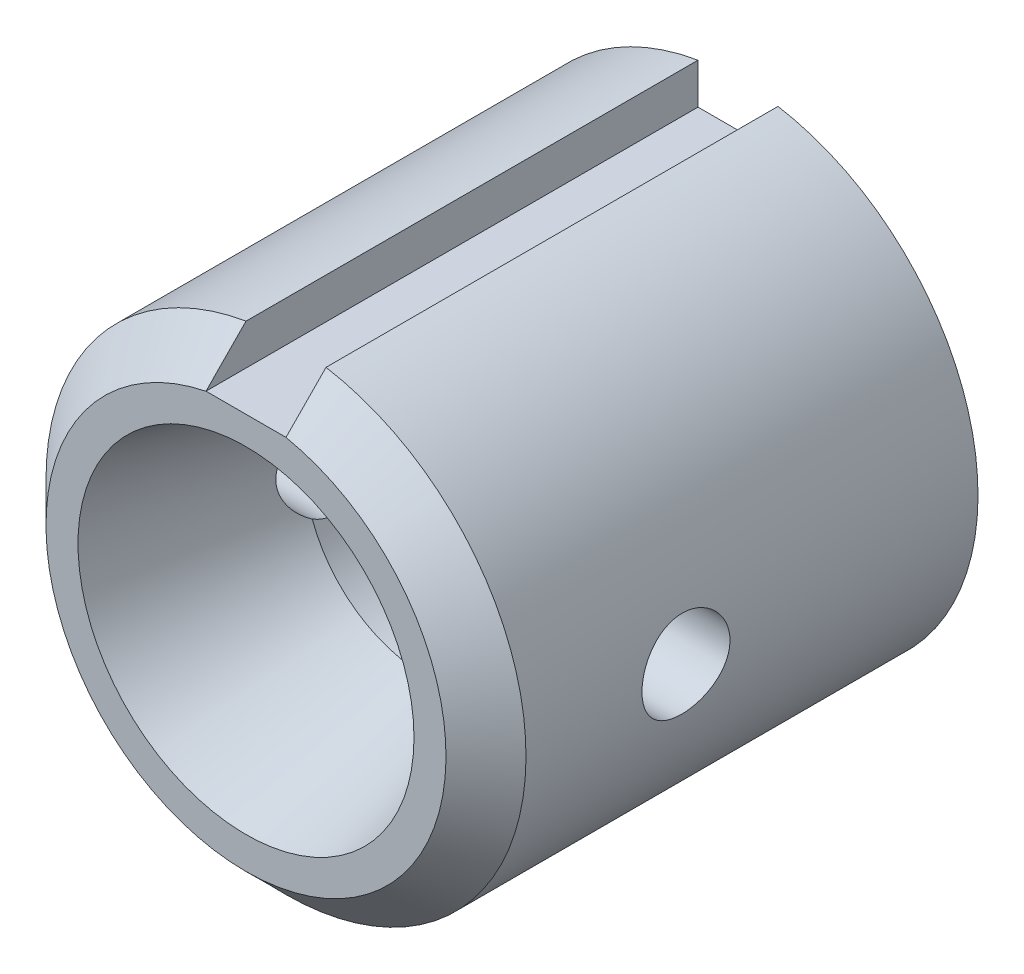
ISO-10303-21;
HEADER;
FILE_DESCRIPTION(('STEP AP214'),'2;1');
FILE_NAME('part.step','',(''),(''),'','','');
FILE_SCHEMA(('AUTOMOTIVE_DESIGN { 1 0 10303 214 1 1 1 1 }'));
ENDSEC;
DATA;
#1=APPLICATION_CONTEXT('core data for automotive mechanical design processes');
#2=APPLICATION_PROTOCOL_DEFINITION('international standard','automotive_design',2000,#1);
#3=PRODUCT_CONTEXT('',#1,'mechanical');
#4=PRODUCT('Part','Part','',(#3));
#5=PRODUCT_RELATED_PRODUCT_CATEGORY('part','',(#4));
#6=PRODUCT_DEFINITION_FORMATION('','',#4);
#7=PRODUCT_DEFINITION_CONTEXT('part definition',#1,'design');
#8=PRODUCT_DEFINITION('design','',#6,#7);
#9=PRODUCT_DEFINITION_SHAPE('','',#8);
#10=(LENGTH_UNIT() NAMED_UNIT(*) SI_UNIT(.MILLI.,.METRE.));
#11=(NAMED_UNIT(*) PLANE_ANGLE_UNIT() SI_UNIT($,.RADIAN.));
#12=(NAMED_UNIT(*) SI_UNIT($,.STERADIAN.) SOLID_ANGLE_UNIT());
#13=UNCERTAINTY_MEASURE_WITH_UNIT(LENGTH_MEASURE(1.E-05),#10,'distance_accuracy_value','');
#14=(GEOMETRIC_REPRESENTATION_CONTEXT(3) GLOBAL_UNCERTAINTY_ASSIGNED_CONTEXT((#13)) GLOBAL_UNIT_ASSIGNED_CONTEXT((#10,
#11,#12)) REPRESENTATION_CONTEXT('',''));
#15=CARTESIAN_POINT('',(0.,0.,0.));
#16=DIRECTION('',(0.,0.,1.));
#17=DIRECTION('',(1.,0.,0.));
#18=AXIS2_PLACEMENT_3D('',#15,#16,#17);
#19=CARTESIAN_POINT('',(60.,295.,6.69999999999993));
#20=DIRECTION('',(0.,0.,1.));
#21=DIRECTION('',(1.,0.,0.));
#22=AXIS2_PLACEMENT_3D('',#19,#20,#21);
#23=CYLINDRICAL_SURFACE('',#22,6.00000000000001);
#24=CARTESIAN_POINT('',(54.0002083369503,294.950000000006,15.1));
#25=CARTESIAN_POINT('',(54.0007202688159,294.888703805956,15.0999976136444));
#26=CARTESIAN_POINT('',(54.0021793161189,294.827384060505,15.0948591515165));
#27=CARTESIAN_POINT('',(54.0068772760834,294.706486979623,15.0744609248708));
#28=CARTESIAN_POINT('',(54.0101177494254,294.646911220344,15.0591922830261));
#29=CARTESIAN_POINT('',(54.0180565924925,294.531267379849,15.019021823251));
#30=CARTESIAN_POINT('',(54.0227536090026,294.475196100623,14.9941289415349));
#31=CARTESIAN_POINT('',(54.0331310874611,294.368037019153,14.9354419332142));
#32=CARTESIAN_POINT('',(54.0388114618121,294.316948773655,14.9016485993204));
#33=CARTESIAN_POINT('',(54.0506392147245,294.22058236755,14.8256843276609));
#34=CARTESIAN_POINT('',(54.0567909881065,294.175373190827,14.7834265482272));
#35=CARTESIAN_POINT('',(54.0688564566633,294.092647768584,14.69191897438));
#36=CARTESIAN_POINT('',(54.0747701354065,294.055132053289,14.6426686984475));
#37=CARTESIAN_POINT('',(54.0857594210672,293.988611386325,14.5381410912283));
#38=CARTESIAN_POINT('',(54.0908288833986,293.959667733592,14.4828240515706));
#39=CARTESIAN_POINT('',(54.099508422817,293.911514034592,14.3679970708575));
#40=CARTESIAN_POINT('',(54.103118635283,293.892303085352,14.3084875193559));
#41=CARTESIAN_POINT('',(54.1084294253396,293.864395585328,14.1877584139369));
#42=CARTESIAN_POINT('',(54.1101534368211,293.855569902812,14.126569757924));
#43=CARTESIAN_POINT('',(54.1115740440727,293.848281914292,14.0035577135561));
#44=CARTESIAN_POINT('',(54.1112708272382,293.849818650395,13.9417343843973));
#45=CARTESIAN_POINT('',(54.1086904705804,293.863111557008,13.8200925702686));
#46=CARTESIAN_POINT('',(54.1064401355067,293.874728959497,13.7602582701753));
#47=CARTESIAN_POINT('',(54.1002528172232,293.907635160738,13.6434043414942));
#48=CARTESIAN_POINT('',(54.0963157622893,293.928924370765,13.5863848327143));
#49=CARTESIAN_POINT('',(54.0871553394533,293.980706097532,13.4763695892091));
#50=CARTESIAN_POINT('',(54.0819241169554,294.011255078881,13.4234011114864));
#51=CARTESIAN_POINT('',(54.0707486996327,294.080646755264,13.3232908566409));
#52=CARTESIAN_POINT('',(54.064804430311,294.119490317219,13.2761496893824));
#53=CARTESIAN_POINT('',(54.0527254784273,294.205127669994,13.1882160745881));
#54=CARTESIAN_POINT('',(54.0465892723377,294.252042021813,13.1475411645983));
#55=CARTESIAN_POINT('',(54.0348733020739,294.352083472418,13.0746204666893));
#56=CARTESIAN_POINT('',(54.029293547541,294.405210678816,13.042374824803));
#57=CARTESIAN_POINT('',(54.0192645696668,294.516347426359,12.9871806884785));
#58=CARTESIAN_POINT('',(54.0148179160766,294.574367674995,12.9642532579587));
#59=CARTESIAN_POINT('',(54.007534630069,294.693538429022,12.9285074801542));
#60=CARTESIAN_POINT('',(54.0046978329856,294.754688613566,12.9156880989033));
#61=CARTESIAN_POINT('',(54.00094206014,294.877443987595,12.9006800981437));
#62=CARTESIAN_POINT('',(53.9999961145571,294.939030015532,12.8983413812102));
#63=CARTESIAN_POINT('',(54.0000039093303,295.061727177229,12.9039671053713));
#64=CARTESIAN_POINT('',(54.0009575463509,295.122838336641,12.9119309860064));
#65=CARTESIAN_POINT('',(54.004599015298,295.242301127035,12.9378026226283));
#66=CARTESIAN_POINT('',(54.0072716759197,295.300672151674,12.9556231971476));
#67=CARTESIAN_POINT('',(54.0140051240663,295.413604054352,13.00061696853));
#68=CARTESIAN_POINT('',(54.0180659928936,295.468164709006,13.0277907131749));
#69=CARTESIAN_POINT('',(54.0271426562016,295.572490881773,13.0910114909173));
#70=CARTESIAN_POINT('',(54.0321670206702,295.622206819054,13.1271390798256));
#71=CARTESIAN_POINT('',(54.0425625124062,295.714926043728,13.2071331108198));
#72=CARTESIAN_POINT('',(54.0479336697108,295.757928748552,13.2510002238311));
#73=CARTESIAN_POINT('',(54.0584705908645,295.836555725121,13.3458878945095));
#74=CARTESIAN_POINT('',(54.0636329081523,295.872080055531,13.3969917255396));
#75=CARTESIAN_POINT('',(54.0730659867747,295.934044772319,13.5045146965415));
#76=CARTESIAN_POINT('',(54.0773367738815,295.960485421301,13.5609336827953));
#77=CARTESIAN_POINT('',(54.0844591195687,296.003419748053,13.6772950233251));
#78=CARTESIAN_POINT('',(54.0873157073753,296.019948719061,13.7372240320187));
#79=CARTESIAN_POINT('',(54.0912836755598,296.042692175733,13.8590627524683));
#80=CARTESIAN_POINT('',(54.0923952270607,296.04890767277,13.9209722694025));
#81=CARTESIAN_POINT('',(54.0927343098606,296.050815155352,14.0440962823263));
#82=CARTESIAN_POINT('',(54.0919877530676,296.04665187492,14.1053085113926));
#83=CARTESIAN_POINT('',(54.0887550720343,296.028236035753,14.226146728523));
#84=CARTESIAN_POINT('',(54.0862689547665,296.013983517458,14.2857727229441));
#85=CARTESIAN_POINT('',(54.0798581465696,295.975853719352,14.4016720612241));
#86=CARTESIAN_POINT('',(54.075935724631,295.951991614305,14.4579505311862));
#87=CARTESIAN_POINT('',(54.0671090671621,295.895334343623,14.5657298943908));
#88=CARTESIAN_POINT('',(54.0622047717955,295.862538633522,14.6172304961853));
#89=CARTESIAN_POINT('',(54.0519089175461,295.78843282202,14.7147228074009));
#90=CARTESIAN_POINT('',(54.0465117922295,295.747016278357,14.760633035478));
#91=CARTESIAN_POINT('',(54.0359147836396,295.65706480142,14.8449011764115));
#92=CARTESIAN_POINT('',(54.0307149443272,295.60852829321,14.8832574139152));
#93=CARTESIAN_POINT('',(54.0210885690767,295.505294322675,14.9515817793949));
#94=CARTESIAN_POINT('',(54.0166678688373,295.45055502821,14.9814875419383));
#95=CARTESIAN_POINT('',(54.0091882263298,295.336768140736,15.0316338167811));
#96=CARTESIAN_POINT('',(54.0061279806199,295.277724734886,15.0518835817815));
#97=CARTESIAN_POINT('',(54.0023561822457,295.173739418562,15.0779473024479));
#98=CARTESIAN_POINT('',(54.0012293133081,295.129408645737,15.0862039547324));
#99=CARTESIAN_POINT('',(53.9999673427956,295.040056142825,15.0972311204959));
#100=CARTESIAN_POINT('',(53.9998322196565,294.995034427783,15.1000017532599));
#101=CARTESIAN_POINT('',(54.0002083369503,294.950000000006,15.1));
#102=B_SPLINE_CURVE_WITH_KNOTS('',3,(#24,#25,#26,#27,#28,#29,#30,#31,#32,#33,#34,#35,#36,#37,
#38,#39,#40,#41,#42,#43,#44,#45,#46,#47,#48,#49,#50,#51,#52,#53,#54,#55,#56,#57,#58,#59,#60,#61,
#62,#63,#64,#65,#66,#67,#68,#69,#70,#71,#72,#73,#74,#75,#76,#77,#78,#79,#80,#81,#82,#83,#84,#85,
#86,#87,#88,#89,#90,#91,#92,#93,#94,#95,#96,#97,#98,#99,#100,#101),.UNSPECIFIED.,.T.,.F.,(4,2,2,
2,2,2,2,2,2,2,2,2,2,2,2,2,2,2,2,2,2,2,2,2,2,2,2,2,2,2,2,2,2,2,2,2,2,2,4),(0.,0.183730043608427,
0.367621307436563,0.551342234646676,0.735046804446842,0.920742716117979,1.10645142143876,
1.29345773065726,1.48044668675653,1.6650851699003,1.84970658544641,2.03182615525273,
2.21395347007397,2.39721450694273,2.58049470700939,2.76679785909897,2.95310423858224,
3.13982945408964,3.3265355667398,3.51055906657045,3.69457255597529,3.87698390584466,
4.05940594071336,4.24353288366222,4.42767579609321,4.61414208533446,4.8006029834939,
4.986395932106,5.17217066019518,5.35536925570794,5.53856711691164,5.72147681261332,
5.90439765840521,6.08972747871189,6.27509835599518,6.46180354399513,6.6483294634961,
6.78331920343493,6.91830600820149),.UNSPECIFIED.);
#103=CARTESIAN_POINT('',(54.0002083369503,294.950000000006,15.1));
#104=VERTEX_POINT('',#103);
#105=EDGE_CURVE('E116',#104,#104,#102,.T.);
#106=ORIENTED_EDGE('',*,*,#105,.T.);
#107=EDGE_LOOP('',(#106));
#108=FACE_BOUND('',#107,.T.);
#109=DIRECTION('',(0.,0.,-1.));
#110=VECTOR('',#109,1.);
#111=CARTESIAN_POINT('',(61.,300.9160797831,19.));
#112=LINE('',#111,#110);
#113=CARTESIAN_POINT('',(61.,300.9160797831,17.9999999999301));
#114=VERTEX_POINT('',#113);
#115=CARTESIAN_POINT('',(61.,300.9160797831,6.69999999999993));
#116=VERTEX_POINT('',#115);
#117=EDGE_CURVE('E217',#114,#116,#112,.T.);
#118=ORIENTED_EDGE('',*,*,#117,.F.);
#119=CARTESIAN_POINT('',(60.,295.,17.9999999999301));
#120=DIRECTION('',(0.,0.,1.));
#121=DIRECTION('',(1.,0.,0.));
#122=AXIS2_PLACEMENT_3D('',#119,#120,#121);
#123=CIRCLE('',#122,6.00000000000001);
#124=CARTESIAN_POINT('',(59.,300.9160797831,17.9999999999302));
#125=VERTEX_POINT('',#124);
#126=EDGE_CURVE('E64',#114,#125,#123,.F.);
#127=ORIENTED_EDGE('',*,*,#126,.T.);
#128=DIRECTION('',(0.,0.,-1.));
#129=VECTOR('',#128,1.);
#130=CARTESIAN_POINT('',(59.,300.9160797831,19.));
#131=LINE('',#130,#129);
#132=CARTESIAN_POINT('',(59.,300.9160797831,6.69999999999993));
#133=VERTEX_POINT('',#132);
#134=EDGE_CURVE('E192',#125,#133,#131,.T.);
#135=ORIENTED_EDGE('',*,*,#134,.T.);
#136=CARTESIAN_POINT('',(60.,295.,6.69999999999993));
#137=DIRECTION('',(0.,0.,1.));
#138=DIRECTION('',(1.,0.,0.));
#139=AXIS2_PLACEMENT_3D('',#136,#137,#138);
#140=CIRCLE('',#139,6.00000000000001);
#141=EDGE_CURVE('E199',#133,#116,#140,.T.);
#142=ORIENTED_EDGE('',*,*,#141,.T.);
#143=EDGE_LOOP('',(#118,#127,#135,#142));
#144=FACE_BOUND('',#143,.T.);
#145=CARTESIAN_POINT('',(65.9997916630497,294.950000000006,15.1));
#146=CARTESIAN_POINT('',(66.0003004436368,295.011181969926,15.0999976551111));
#147=CARTESIAN_POINT('',(65.9998661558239,295.072402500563,15.0948783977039));
#148=CARTESIAN_POINT('',(65.9971955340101,295.193136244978,15.0745412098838));
#149=CARTESIAN_POINT('',(65.9949576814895,295.252647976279,15.0593147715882));
#150=CARTESIAN_POINT('',(65.9889710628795,295.368199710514,15.0192372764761));
#151=CARTESIAN_POINT('',(65.9852235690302,295.424242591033,14.994394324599));
#152=CARTESIAN_POINT('',(65.9766665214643,295.531364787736,14.9358111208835));
#153=CARTESIAN_POINT('',(65.9718570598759,295.582444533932,14.9020716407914));
#154=CARTESIAN_POINT('',(65.9616835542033,295.678748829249,14.8262665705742));
#155=CARTESIAN_POINT('',(65.9563145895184,295.723911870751,14.7841234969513));
#156=CARTESIAN_POINT('',(65.9456861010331,295.806571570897,14.6928747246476));
#157=CARTESIAN_POINT('',(65.9404265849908,295.844067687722,14.6437685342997));
#158=CARTESIAN_POINT('',(65.9305917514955,295.910618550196,14.5395062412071));
#159=CARTESIAN_POINT('',(65.9260222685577,295.939603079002,14.4843047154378));
#160=CARTESIAN_POINT('',(65.9181687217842,295.98786671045,14.3697247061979));
#161=CARTESIAN_POINT('',(65.914884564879,296.007146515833,14.3103465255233));
#162=CARTESIAN_POINT('',(65.9100270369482,296.035270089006,14.1897049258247));
#163=CARTESIAN_POINT('',(65.9084374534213,296.044212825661,14.1284652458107));
#164=CARTESIAN_POINT('',(65.907106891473,296.051714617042,14.0053356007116));
#165=CARTESIAN_POINT('',(65.9073657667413,296.050274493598,13.9434456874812));
#166=CARTESIAN_POINT('',(65.9096862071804,296.037136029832,13.8215315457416));
#167=CARTESIAN_POINT('',(65.9117267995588,296.02555703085,13.7614939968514));
#168=CARTESIAN_POINT('',(65.9173395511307,295.992657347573,13.6442267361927));
#169=CARTESIAN_POINT('',(65.9209117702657,295.971336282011,13.5869971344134));
#170=CARTESIAN_POINT('',(65.9291923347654,295.919439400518,13.4766203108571));
#171=CARTESIAN_POINT('',(65.9339065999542,295.888815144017,13.4234963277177));
#172=CARTESIAN_POINT('',(65.9439147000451,295.819213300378,13.3230950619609));
#173=CARTESIAN_POINT('',(65.9492085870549,295.780234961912,13.2758183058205));
#174=CARTESIAN_POINT('',(65.9598411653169,295.694395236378,13.1877766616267));
#175=CARTESIAN_POINT('',(65.965179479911,295.64743338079,13.147109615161));
#176=CARTESIAN_POINT('',(65.9751983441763,295.54729563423,13.0742176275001));
#177=CARTESIAN_POINT('',(65.9798788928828,295.494119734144,13.0419926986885));
#178=CARTESIAN_POINT('',(65.9880210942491,295.383017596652,12.9869155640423));
#179=CARTESIAN_POINT('',(65.9914825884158,295.325090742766,12.9640645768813));
#180=CARTESIAN_POINT('',(65.9967527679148,295.206146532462,12.9284393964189));
#181=CARTESIAN_POINT('',(65.9985616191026,295.145129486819,12.9156641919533));
#182=CARTESIAN_POINT('',(66.0002655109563,295.022644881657,12.9006926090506));
#183=CARTESIAN_POINT('',(66.0001867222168,294.961195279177,12.8983521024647));
#184=CARTESIAN_POINT('',(65.9981463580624,294.838796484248,12.9039221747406));
#185=CARTESIAN_POINT('',(65.9961848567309,294.777847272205,12.9118323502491));
#186=CARTESIAN_POINT('',(65.9905729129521,294.65855865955,12.9375675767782));
#187=CARTESIAN_POINT('',(65.9869329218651,294.60020552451,12.9553314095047));
#188=CARTESIAN_POINT('',(65.9783240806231,294.487311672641,13.0001951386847));
#189=CARTESIAN_POINT('',(65.9733551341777,294.432771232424,13.0272957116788));
#190=CARTESIAN_POINT('',(65.962523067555,294.328353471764,13.0904281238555));
#191=CARTESIAN_POINT('',(65.9566502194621,294.27853776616,13.1265601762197));
#192=CARTESIAN_POINT('',(65.9446610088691,294.185626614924,13.2065936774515));
#193=CARTESIAN_POINT('',(65.9385446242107,294.142531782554,13.2504958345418));
#194=CARTESIAN_POINT('',(65.9266354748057,294.063728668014,13.345493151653));
#195=CARTESIAN_POINT('',(65.9208477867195,294.028120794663,13.3966723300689));
#196=CARTESIAN_POINT('',(65.910318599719,293.96601232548,13.504386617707));
#197=CARTESIAN_POINT('',(65.9055770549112,293.93951133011,13.5609214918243));
#198=CARTESIAN_POINT('',(65.8977001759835,293.896546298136,13.6774079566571));
#199=CARTESIAN_POINT('',(65.8945554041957,293.88002317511,13.7373370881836));
#200=CARTESIAN_POINT('',(65.8901913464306,293.857291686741,13.859186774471));
#201=CARTESIAN_POINT('',(65.8889718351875,293.851082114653,13.9211070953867));
#202=CARTESIAN_POINT('',(65.8886028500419,293.849192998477,14.0440869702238));
#203=CARTESIAN_POINT('',(65.8894195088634,293.853341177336,14.10514384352));
#204=CARTESIAN_POINT('',(65.8929589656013,293.871673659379,14.2256726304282));
#205=CARTESIAN_POINT('',(65.8956817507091,293.885857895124,14.2851445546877));
#206=CARTESIAN_POINT('',(65.9027228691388,293.923788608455,14.4007288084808));
#207=CARTESIAN_POINT('',(65.9070382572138,293.947517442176,14.4568471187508));
#208=CARTESIAN_POINT('',(65.9167969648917,294.003843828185,14.5643321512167));
#209=CARTESIAN_POINT('',(65.9222403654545,294.036442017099,14.6156985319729));
#210=CARTESIAN_POINT('',(65.9337698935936,294.110177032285,14.7130814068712));
#211=CARTESIAN_POINT('',(65.9398646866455,294.151438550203,14.7590024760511));
#212=CARTESIAN_POINT('',(65.9519794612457,294.241065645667,14.8433259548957));
#213=CARTESIAN_POINT('',(65.9579994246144,294.28943291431,14.881726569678));
#214=CARTESIAN_POINT('',(65.9693903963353,294.392472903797,14.950279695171));
#215=CARTESIAN_POINT('',(65.9747543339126,294.447203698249,14.980346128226));
#216=CARTESIAN_POINT('',(65.9841912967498,294.561020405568,15.0308067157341));
#217=CARTESIAN_POINT('',(65.9882655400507,294.620102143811,15.0512100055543));
#218=CARTESIAN_POINT('',(65.9938325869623,294.724467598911,15.077588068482));
#219=CARTESIAN_POINT('',(65.9957260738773,294.769135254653,15.0859775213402));
#220=CARTESIAN_POINT('',(65.9985167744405,294.85919487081,15.0971842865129));
#221=CARTESIAN_POINT('',(65.9994140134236,294.904586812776,15.1000017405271));
#222=CARTESIAN_POINT('',(65.9997916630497,294.950000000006,15.1));
#223=B_SPLINE_CURVE_WITH_KNOTS('',3,(#145,#146,#147,#148,#149,#150,#151,#152,#153,#154,#155,
#156,#157,#158,#159,#160,#161,#162,#163,#164,#165,#166,#167,#168,#169,#170,#171,#172,#173,#174,
#175,#176,#177,#178,#179,#180,#181,#182,#183,#184,#185,#186,#187,#188,#189,#190,#191,#192,#193,
#194,#195,#196,#197,#198,#199,#200,#201,#202,#203,#204,#205,#206,#207,#208,#209,#210,#211,#212,
#213,#214,#215,#216,#217,#218,#219,#220,#221,#222),.UNSPECIFIED.,.T.,.F.,(4,2,2,2,2,2,2,2,2,2,2,
2,2,2,2,2,2,2,2,2,2,2,2,2,2,2,2,2,2,2,2,2,2,2,2,2,2,2,4),(0.,0.183386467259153,
0.366927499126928,0.550314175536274,0.733684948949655,0.918831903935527,1.10399193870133,
1.29063911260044,1.47727276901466,1.66210436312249,1.84692132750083,2.0295916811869,
2.21226918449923,2.3959146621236,2.57957666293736,2.76574908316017,2.95192177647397,
3.13811866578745,3.32429686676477,3.5078953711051,3.69148665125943,3.87394989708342,
4.05642636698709,4.24102521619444,4.42564089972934,4.61259355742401,4.79953801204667,
4.98536428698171,5.17116881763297,5.35390357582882,5.53663710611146,5.71903438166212,
5.9014447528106,6.08668671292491,6.27197283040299,6.45910680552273,6.64606351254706,
6.78218818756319,6.91830940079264),.UNSPECIFIED.);
#224=CARTESIAN_POINT('',(65.9997916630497,294.950000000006,15.1));
#225=VERTEX_POINT('',#224);
#226=EDGE_CURVE('E118',#225,#225,#223,.T.);
#227=ORIENTED_EDGE('',*,*,#226,.T.);
#228=EDGE_LOOP('',(#227));
#229=FACE_BOUND('',#228,.T.);
#230=ADVANCED_FACE('F36',(#108,#144,#229),#23,.T.);
#231=CARTESIAN_POINT('',(60.,295.,6.69999999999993));
#232=DIRECTION('',(0.,0.,-1.));
#233=DIRECTION('',(-1.,0.,0.));
#234=AXIS2_PLACEMENT_3D('',#231,#232,#233);
#235=CYLINDRICAL_SURFACE('',#234,3.00000000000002);
#236=CARTESIAN_POINT('',(60.,295.,6.69999999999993));
#237=DIRECTION('',(0.,0.,-1.));
#238=DIRECTION('',(-1.,0.,0.));
#239=AXIS2_PLACEMENT_3D('',#236,#237,#238);
#240=CIRCLE('',#239,3.00000000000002);
#241=CARTESIAN_POINT('',(57.,295.,6.69999999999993));
#242=VERTEX_POINT('',#241);
#243=EDGE_CURVE('E146',#242,#242,#240,.T.);
#244=ORIENTED_EDGE('',*,*,#243,.T.);
#245=EDGE_LOOP('',(#244));
#246=FACE_BOUND('',#245,.T.);
#247=CARTESIAN_POINT('',(62.9995833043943,294.950000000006,15.1));
#248=CARTESIAN_POINT('',(63.0005759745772,295.009464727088,15.10000192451));
#249=CARTESIAN_POINT('',(62.9997818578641,295.068946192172,15.0951631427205));
#250=CARTESIAN_POINT('',(62.9947907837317,295.186198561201,15.0759822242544));
#251=CARTESIAN_POINT('',(62.9905943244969,295.243969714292,15.061641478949));
#252=CARTESIAN_POINT('',(62.9793242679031,295.356090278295,15.0240037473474));
#253=CARTESIAN_POINT('',(62.9722555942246,295.410445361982,15.0007220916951));
#254=CARTESIAN_POINT('',(62.9560222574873,295.514498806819,14.9459390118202));
#255=CARTESIAN_POINT('',(62.9468570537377,295.56419596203,14.9144354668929));
#256=CARTESIAN_POINT('',(62.927050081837,295.659412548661,14.8428535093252));
#257=CARTESIAN_POINT('',(62.9163684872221,295.704730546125,14.8025183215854));
#258=CARTESIAN_POINT('',(62.894942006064,295.788142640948,14.7149647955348));
#259=CARTESIAN_POINT('',(62.8841971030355,295.826234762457,14.6677445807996));
#260=CARTESIAN_POINT('',(62.8634619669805,295.895513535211,14.5656402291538));
#261=CARTESIAN_POINT('',(62.8535146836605,295.926390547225,14.5105363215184));
#262=CARTESIAN_POINT('',(62.83611660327,295.978365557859,14.3955282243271));
#263=CARTESIAN_POINT('',(62.8286650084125,295.999466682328,14.3356255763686));
#264=CARTESIAN_POINT('',(62.8174834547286,296.030559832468,14.2148211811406));
#265=CARTESIAN_POINT('',(62.8136369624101,296.040900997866,14.1540204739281));
#266=CARTESIAN_POINT('',(62.80978080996,296.051268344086,14.0314345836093));
#267=CARTESIAN_POINT('',(62.809769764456,296.051298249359,13.9696497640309));
#268=CARTESIAN_POINT('',(62.8134799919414,296.041322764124,13.8502860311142));
#269=CARTESIAN_POINT('',(62.8170062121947,296.031841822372,13.7926560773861));
#270=CARTESIAN_POINT('',(62.8270526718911,296.003987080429,13.6798641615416));
#271=CARTESIAN_POINT('',(62.8335733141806,295.985612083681,13.6247025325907));
#272=CARTESIAN_POINT('',(62.848964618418,295.940202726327,13.5173491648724));
#273=CARTESIAN_POINT('',(62.8578719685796,295.91303166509,13.4652207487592));
#274=CARTESIAN_POINT('',(62.8769854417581,295.850887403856,13.3661023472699));
#275=CARTESIAN_POINT('',(62.8871919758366,295.815911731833,13.3191139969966));
#276=CARTESIAN_POINT('',(62.9084323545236,295.736745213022,13.228737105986));
#277=CARTESIAN_POINT('',(62.9194798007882,295.692136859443,13.185716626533));
#278=CARTESIAN_POINT('',(62.9405732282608,295.596187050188,13.1076619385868));
#279=CARTESIAN_POINT('',(62.9506191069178,295.544844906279,13.0726285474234));
#280=CARTESIAN_POINT('',(62.9686391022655,295.436166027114,13.0112775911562));
#281=CARTESIAN_POINT('',(62.9765921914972,295.378776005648,12.9850478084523));
#282=CARTESIAN_POINT('',(62.9893032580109,295.260044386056,12.9427204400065));
#283=CARTESIAN_POINT('',(62.9940625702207,295.198704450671,12.9266186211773));
#284=CARTESIAN_POINT('',(62.9995935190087,295.077151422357,12.9057230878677));
#285=CARTESIAN_POINT('',(63.0005544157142,295.01703788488,12.9003993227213));
#286=CARTESIAN_POINT('',(62.9988270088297,294.896808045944,12.8996442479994));
#287=CARTESIAN_POINT('',(62.9961393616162,294.836691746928,12.90421115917));
#288=CARTESIAN_POINT('',(62.9874731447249,294.720155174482,12.9227151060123));
#289=CARTESIAN_POINT('',(62.9816020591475,294.663678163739,12.9363492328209));
#290=CARTESIAN_POINT('',(62.9671610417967,294.553878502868,12.9721749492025));
#291=CARTESIAN_POINT('',(62.9585907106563,294.5005563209,12.9943678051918));
#292=CARTESIAN_POINT('',(62.9391836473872,294.3966015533,13.0474924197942));
#293=CARTESIAN_POINT('',(62.928280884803,294.346117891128,13.0786908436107));
#294=CARTESIAN_POINT('',(62.9053955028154,294.250949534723,13.1486369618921));
#295=CARTESIAN_POINT('',(62.8934124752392,294.206267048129,13.1873875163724));
#296=CARTESIAN_POINT('',(62.8687911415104,294.121304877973,13.2739503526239));
#297=CARTESIAN_POINT('',(62.8561544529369,294.081421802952,13.3221534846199));
#298=CARTESIAN_POINT('',(62.8322813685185,294.010254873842,13.4248633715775));
#299=CARTESIAN_POINT('',(62.8210450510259,293.978971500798,13.4793704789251));
#300=CARTESIAN_POINT('',(62.8013143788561,293.926016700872,13.5933065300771));
#301=CARTESIAN_POINT('',(62.7928180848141,293.904338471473,13.6527319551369));
#302=CARTESIAN_POINT('',(62.7796918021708,293.871446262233,13.7748088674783));
#303=CARTESIAN_POINT('',(62.7750592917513,293.860225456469,13.8374582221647));
#304=CARTESIAN_POINT('',(62.7704831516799,293.849150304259,13.9596036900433));
#305=CARTESIAN_POINT('',(62.770241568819,293.848573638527,14.0190238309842));
#306=CARTESIAN_POINT('',(62.773716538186,293.856970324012,14.1370617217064));
#307=CARTESIAN_POINT('',(62.7774327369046,293.865942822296,14.1956795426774));
#308=CARTESIAN_POINT('',(62.7881822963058,293.892644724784,14.308657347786));
#309=CARTESIAN_POINT('',(62.7951120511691,293.910101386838,14.3630924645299));
#310=CARTESIAN_POINT('',(62.8114759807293,293.9530386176,14.4682927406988));
#311=CARTESIAN_POINT('',(62.8209107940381,293.978521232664,14.519056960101));
#312=CARTESIAN_POINT('',(62.841900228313,294.038406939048,14.61850629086));
#313=CARTESIAN_POINT('',(62.8535428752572,294.073223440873,14.6669236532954));
#314=CARTESIAN_POINT('',(62.8773825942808,294.150124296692,14.7574489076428));
#315=CARTESIAN_POINT('',(62.8895798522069,294.192211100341,14.7995546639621));
#316=CARTESIAN_POINT('',(62.91405170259,294.28533447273,14.8787286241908));
#317=CARTESIAN_POINT('',(62.926290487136,294.336746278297,14.9153684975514));
#318=CARTESIAN_POINT('',(62.9488141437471,294.445409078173,14.9794727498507));
#319=CARTESIAN_POINT('',(62.9590988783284,294.502660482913,15.0069364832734));
#320=CARTESIAN_POINT('',(62.9769360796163,294.623558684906,15.0524974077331));
#321=CARTESIAN_POINT('',(62.9843800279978,294.687359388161,15.0702321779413));
#322=CARTESIAN_POINT('',(62.9951492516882,294.817433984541,15.093979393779));
#323=CARTESIAN_POINT('',(62.9984766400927,294.883706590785,15.0999978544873));
#324=CARTESIAN_POINT('',(62.9995833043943,294.950000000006,15.1));
#325=B_SPLINE_CURVE_WITH_KNOTS('',3,(#247,#248,#249,#250,#251,#252,#253,#254,#255,#256,#257,
#258,#259,#260,#261,#262,#263,#264,#265,#266,#267,#268,#269,#270,#271,#272,#273,#274,#275,#276,
#277,#278,#279,#280,#281,#282,#283,#284,#285,#286,#287,#288,#289,#290,#291,#292,#293,#294,#295,
#296,#297,#298,#299,#300,#301,#302,#303,#304,#305,#306,#307,#308,#309,#310,#311,#312,#313,#314,
#315,#316,#317,#318,#319,#320,#321,#322,#323,#324),.UNSPECIFIED.,.T.,.F.,(4,2,2,2,2,2,2,2,2,2,2,
2,2,2,2,2,2,2,2,2,2,2,2,2,2,2,2,2,2,2,2,2,2,2,2,2,2,2,4),(0.,0.178176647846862,0.35632721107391,
0.534173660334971,0.712066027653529,0.896052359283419,1.08008892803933,1.27097245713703,
1.46179490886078,1.64621170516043,1.83056188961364,2.00527635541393,2.18001433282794,
2.35760997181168,2.53526194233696,2.72324133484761,2.91123995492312,3.10106101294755,
3.29080268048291,3.47096131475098,3.65108754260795,3.8254797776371,3.99989782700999,
4.1801304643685,4.36043148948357,4.55101869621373,4.74161656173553,4.9320792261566,
5.12241748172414,5.29978787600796,5.47714242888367,5.64913896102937,5.82117938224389,
6.00267834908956,6.1842385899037,6.37622860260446,6.56823211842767,6.76697189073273,
6.96560960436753),.UNSPECIFIED.);
#326=CARTESIAN_POINT('',(62.855932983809,295.918502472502,14.5215390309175));
#327=VERTEX_POINT('',#326);
#328=CARTESIAN_POINT('',(62.8218172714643,293.981497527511,14.5215390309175));
#329=VERTEX_POINT('',#328);
#330=EDGE_CURVE('E111',#327,#329,#325,.T.);
#331=ORIENTED_EDGE('',*,*,#330,.F.);
#332=CARTESIAN_POINT('',(60.,295.,14.5215390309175));
#333=DIRECTION('',(0.,0.,1.));
#334=DIRECTION('',(1.,0.,0.));
#335=AXIS2_PLACEMENT_3D('',#332,#333,#334);
#336=CIRCLE('',#335,3.00000000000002);
#337=CARTESIAN_POINT('',(57.144067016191,295.918502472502,14.5215390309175));
#338=VERTEX_POINT('',#337);
#339=EDGE_CURVE('E101',#327,#338,#336,.T.);
#340=ORIENTED_EDGE('',*,*,#339,.T.);
#341=CARTESIAN_POINT('',(57.,295.,15.0988630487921));
#342=CARTESIAN_POINT('',(56.9999987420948,294.940547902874,15.1015699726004));
#343=CARTESIAN_POINT('',(57.0017828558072,294.88088745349,15.0994328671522));
#344=CARTESIAN_POINT('',(57.0088001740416,294.762904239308,15.0855974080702));
#345=CARTESIAN_POINT('',(57.0140328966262,294.704581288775,15.0739003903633));
#346=CARTESIAN_POINT('',(57.0274604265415,294.591005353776,15.04144461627));
#347=CARTESIAN_POINT('',(57.0356499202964,294.535747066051,15.02070210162));
#348=CARTESIAN_POINT('',(57.0542420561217,294.429543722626,14.970859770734));
#349=CARTESIAN_POINT('',(57.0646452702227,294.378599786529,14.941757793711));
#350=CARTESIAN_POINT('',(57.0871309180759,294.280399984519,14.8748112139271));
#351=CARTESIAN_POINT('',(57.0992606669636,294.233345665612,14.8366871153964));
#352=CARTESIAN_POINT('',(57.1237261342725,294.146124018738,14.7532775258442));
#353=CARTESIAN_POINT('',(57.1360619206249,294.105959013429,14.7079896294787));
#354=CARTESIAN_POINT('',(57.1602183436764,294.031895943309,14.6091480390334));
#355=CARTESIAN_POINT('',(57.17199312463,293.998347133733,14.5553201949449));
#356=CARTESIAN_POINT('',(57.1930187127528,293.940850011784,14.4423030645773));
#357=CARTESIAN_POINT('',(57.202270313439,293.916898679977,14.3831154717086));
#358=CARTESIAN_POINT('',(57.2167736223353,293.880164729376,14.2631527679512));
#359=CARTESIAN_POINT('',(57.2221523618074,293.867025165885,14.2025029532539));
#360=CARTESIAN_POINT('',(57.2286818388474,293.851142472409,14.0796451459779));
#361=CARTESIAN_POINT('',(57.2298347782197,293.848393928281,14.0174379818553));
#362=CARTESIAN_POINT('',(57.2278272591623,293.853239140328,13.8977108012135));
#363=CARTESIAN_POINT('',(57.2249515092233,293.860150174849,13.8401567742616));
#364=CARTESIAN_POINT('',(57.2157453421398,293.882827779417,13.7271124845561));
#365=CARTESIAN_POINT('',(57.2094145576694,293.898595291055,13.6716224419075));
#366=CARTESIAN_POINT('',(57.1939739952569,293.938550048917,13.5637660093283));
#367=CARTESIAN_POINT('',(57.1848460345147,293.962792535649,13.5114228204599));
#368=CARTESIAN_POINT('',(57.164787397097,294.018951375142,13.4114079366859));
#369=CARTESIAN_POINT('',(57.1538561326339,294.050870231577,13.3637377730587));
#370=CARTESIAN_POINT('',(57.1304498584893,294.124068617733,13.2709125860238));
#371=CARTESIAN_POINT('',(57.1179203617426,294.165844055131,13.2261617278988));
#372=CARTESIAN_POINT('',(57.0932652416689,294.256300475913,13.144131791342));
#373=CARTESIAN_POINT('',(57.0811397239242,294.304983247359,13.1068546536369));
#374=CARTESIAN_POINT('',(57.0581333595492,294.409760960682,13.039723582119));
#375=CARTESIAN_POINT('',(57.0473033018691,294.466040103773,13.0101382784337));
#376=CARTESIAN_POINT('',(57.0284945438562,294.583260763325,12.9609923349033));
#377=CARTESIAN_POINT('',(57.0205147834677,294.644200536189,12.9414279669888));
#378=CARTESIAN_POINT('',(57.0085330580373,294.766106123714,12.9137623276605));
#379=CARTESIAN_POINT('',(57.0043685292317,294.826947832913,12.905185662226));
#380=CARTESIAN_POINT('',(56.9998034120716,294.949342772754,12.8982952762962));
#381=CARTESIAN_POINT('',(56.9994016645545,295.010895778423,12.8999783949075));
#382=CARTESIAN_POINT('',(57.0022479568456,295.129819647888,12.9132283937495));
#383=CARTESIAN_POINT('',(57.0053211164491,295.187249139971,12.9243152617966));
#384=CARTESIAN_POINT('',(57.0144477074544,295.299407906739,12.9553466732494));
#385=CARTESIAN_POINT('',(57.0205013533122,295.354136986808,12.9752918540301));
#386=CARTESIAN_POINT('',(57.0350301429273,295.460292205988,13.0237533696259));
#387=CARTESIAN_POINT('',(57.0435397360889,295.51165761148,13.0523919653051));
#388=CARTESIAN_POINT('',(57.0620471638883,295.609009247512,13.1173150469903));
#389=CARTESIAN_POINT('',(57.072045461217,295.654993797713,13.1536019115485));
#390=CARTESIAN_POINT('',(57.093069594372,295.742905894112,13.2350922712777));
#391=CARTESIAN_POINT('',(57.1041217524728,295.784478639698,13.2806723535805));
#392=CARTESIAN_POINT('',(57.1254976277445,295.85951269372,13.3782481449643));
#393=CARTESIAN_POINT('',(57.1358212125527,295.89297253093,13.4302450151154));
#394=CARTESIAN_POINT('',(57.1546613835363,295.951319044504,13.5403224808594));
#395=CARTESIAN_POINT('',(57.1631446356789,295.976051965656,13.5984907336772));
#396=CARTESIAN_POINT('',(57.1769341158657,296.015251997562,13.7185394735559));
#397=CARTESIAN_POINT('',(57.1822419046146,296.029724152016,13.7804181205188));
#398=CARTESIAN_POINT('',(57.188746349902,296.047347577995,13.9027713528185));
#399=CARTESIAN_POINT('',(57.190137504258,296.05103480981,13.9631584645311));
#400=CARTESIAN_POINT('',(57.189177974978,296.048466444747,14.0836841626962));
#401=CARTESIAN_POINT('',(57.1868279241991,296.0422125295,14.1438227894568));
#402=CARTESIAN_POINT('',(57.1788566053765,296.020428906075,14.2598931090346));
#403=CARTESIAN_POINT('',(57.1733563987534,296.00524194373,14.3158983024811));
#404=CARTESIAN_POINT('',(57.1598440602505,295.966402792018,14.4245664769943));
#405=CARTESIAN_POINT('',(57.1518313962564,295.942748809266,14.4772287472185));
#406=CARTESIAN_POINT('',(57.1338450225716,295.886597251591,14.5799508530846));
#407=CARTESIAN_POINT('',(57.1238076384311,295.853793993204,14.6298321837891));
#408=CARTESIAN_POINT('',(57.1030990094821,295.780645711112,14.7235779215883));
#409=CARTESIAN_POINT('',(57.0924275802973,295.740298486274,14.7674405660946));
#410=CARTESIAN_POINT('',(57.0710492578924,295.650745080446,14.8502114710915));
#411=CARTESIAN_POINT('',(57.0603684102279,295.601191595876,14.8887520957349));
#412=CARTESIAN_POINT('',(57.0408021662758,295.495991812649,14.9569867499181));
#413=CARTESIAN_POINT('',(57.031916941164,295.440344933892,14.9866799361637));
#414=CARTESIAN_POINT('',(57.016738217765,295.322215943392,15.0371763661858));
#415=CARTESIAN_POINT('',(57.0105572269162,295.259553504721,15.0575948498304));
#416=CARTESIAN_POINT('',(57.0021897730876,295.131344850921,15.0869374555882));
#417=CARTESIAN_POINT('',(57.0000013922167,295.065800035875,15.0958670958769));
#418=CARTESIAN_POINT('',(57.,295.,15.0988630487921));
#419=B_SPLINE_CURVE_WITH_KNOTS('',3,(#341,#342,#343,#344,#345,#346,#347,#348,#349,#350,#351,
#352,#353,#354,#355,#356,#357,#358,#359,#360,#361,#362,#363,#364,#365,#366,#367,#368,#369,#370,
#371,#372,#373,#374,#375,#376,#377,#378,#379,#380,#381,#382,#383,#384,#385,#386,#387,#388,#389,
#390,#391,#392,#393,#394,#395,#396,#397,#398,#399,#400,#401,#402,#403,#404,#405,#406,#407,#408,
#409,#410,#411,#412,#413,#414,#415,#416,#417,#418),.UNSPECIFIED.,.T.,.F.,(4,2,2,2,2,2,2,2,2,2,2,
2,2,2,2,2,2,2,2,2,2,2,2,2,2,2,2,2,2,2,2,2,2,2,2,2,2,2,4),(0.,0.178299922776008,
0.356574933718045,0.53453115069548,0.712533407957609,0.897010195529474,1.08154905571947,
1.27412747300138,1.46664525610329,1.6525185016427,1.83829488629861,2.01158465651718,
2.18489285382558,2.35935242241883,2.53386896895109,2.72049730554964,2.90717404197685,
3.09968924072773,3.29213276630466,3.4759327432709,3.65967609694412,3.83456842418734,
4.00947333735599,4.18696194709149,4.3645058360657,4.55166916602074,4.73886641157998,
4.92921402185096,5.11946800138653,5.30009170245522,5.48068485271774,5.6547634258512,
5.8288788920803,6.00970440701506,6.19058276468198,6.38070270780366,6.57084076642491,
6.76827335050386,6.96561107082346),.UNSPECIFIED.);
#420=CARTESIAN_POINT('',(57.1781827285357,293.981497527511,14.5215390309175));
#421=VERTEX_POINT('',#420);
#422=EDGE_CURVE('E109',#421,#338,#419,.T.);
#423=ORIENTED_EDGE('',*,*,#422,.F.);
#424=EDGE_CURVE('E56',#421,#329,#336,.T.);
#425=ORIENTED_EDGE('',*,*,#424,.T.);
#426=EDGE_LOOP('',(#331,#340,#423,#425));
#427=FACE_BOUND('',#426,.T.);
#428=ADVANCED_FACE('F108',(#246,#427),#235,.F.);
#429=CARTESIAN_POINT('',(66.,295.,6.69999999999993));
#430=DIRECTION('',(0.,0.,-1.));
#431=DIRECTION('',(-1.,0.,0.));
#432=AXIS2_PLACEMENT_3D('',#429,#430,#431);
#433=PLANE('',#432);
#434=ORIENTED_EDGE('',*,*,#243,.F.);
#435=EDGE_LOOP('',(#434));
#436=FACE_BOUND('',#435,.T.);
#437=DIRECTION('',(0.,1.,0.));
#438=VECTOR('',#437,1.);
#439=CARTESIAN_POINT('',(59.,299.9,6.69999999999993));
#440=LINE('',#439,#438);
#441=CARTESIAN_POINT('',(59.,299.9,6.69999999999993));
#442=VERTEX_POINT('',#441);
#443=EDGE_CURVE('E196',#442,#133,#440,.T.);
#444=ORIENTED_EDGE('',*,*,#443,.F.);
#445=DIRECTION('',(-1.,0.,0.));
#446=VECTOR('',#445,1.);
#447=CARTESIAN_POINT('',(61.,299.9,6.69999999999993));
#448=LINE('',#447,#446);
#449=CARTESIAN_POINT('',(61.,299.9,6.69999999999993));
#450=VERTEX_POINT('',#449);
#451=EDGE_CURVE('E224',#450,#442,#448,.T.);
#452=ORIENTED_EDGE('',*,*,#451,.F.);
#453=DIRECTION('',(0.,-1.,0.));
#454=VECTOR('',#453,1.);
#455=CARTESIAN_POINT('',(61.,300.9160797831,6.69999999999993));
#456=LINE('',#455,#454);
#457=EDGE_CURVE('E227',#116,#450,#456,.T.);
#458=ORIENTED_EDGE('',*,*,#457,.F.);
#459=ORIENTED_EDGE('',*,*,#141,.F.);
#460=EDGE_LOOP('',(#444,#452,#458,#459));
#461=FACE_BOUND('',#460,.T.);
#462=ADVANCED_FACE('F152',(#436,#461),#433,.T.);
#463=CARTESIAN_POINT('',(60.,295.,19.));
#464=DIRECTION('',(0.,0.,1.));
#465=DIRECTION('',(1.,0.,0.));
#466=AXIS2_PLACEMENT_3D('',#463,#464,#465);
#467=PLANE('',#466);
#468=CARTESIAN_POINT('',(60.,295.,19.));
#469=DIRECTION('',(0.,0.,1.));
#470=DIRECTION('',(1.,0.,0.));
#471=AXIS2_PLACEMENT_3D('',#468,#469,#470);
#472=CIRCLE('',#471,4.19999999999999);
#473=CARTESIAN_POINT('',(64.2,295.,19.));
#474=VERTEX_POINT('',#473);
#475=EDGE_CURVE('E246',#474,#474,#472,.T.);
#476=ORIENTED_EDGE('',*,*,#475,.F.);
#477=EDGE_LOOP('',(#476));
#478=FACE_BOUND('',#477,.T.);
#479=DIRECTION('',(-1.,0.,0.));
#480=VECTOR('',#479,1.);
#481=CARTESIAN_POINT('',(61.,299.9,19.));
#482=LINE('',#481,#480);
#483=CARTESIAN_POINT('',(60.9949874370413,299.9,19.));
#484=VERTEX_POINT('',#483);
#485=CARTESIAN_POINT('',(59.0050125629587,299.9,19.));
#486=VERTEX_POINT('',#485);
#487=EDGE_CURVE('E220',#484,#486,#482,.T.);
#488=ORIENTED_EDGE('',*,*,#487,.T.);
#489=CARTESIAN_POINT('',(60.,295.,19.));
#490=DIRECTION('',(0.,0.,1.));
#491=DIRECTION('',(1.,0.,0.));
#492=AXIS2_PLACEMENT_3D('',#489,#490,#491);
#493=CIRCLE('',#492,4.99999999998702);
#494=EDGE_CURVE('E208',#486,#484,#493,.T.);
#495=ORIENTED_EDGE('',*,*,#494,.T.);
#496=EDGE_LOOP('',(#488,#495));
#497=FACE_BOUND('',#496,.T.);
#498=ADVANCED_FACE('F156',(#478,#497),#467,.T.);
#499=CARTESIAN_POINT('',(59.,299.9,19.));
#500=DIRECTION('',(-1.,0.,0.));
#501=DIRECTION('',(0.,-1.,0.));
#502=AXIS2_PLACEMENT_3D('',#499,#500,#501);
#503=PLANE('',#502);
#504=ORIENTED_EDGE('',*,*,#134,.F.);
#505=CARTESIAN_POINT('',(59.,300.9160797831,17.9999999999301));
#506=CARTESIAN_POINT('',(59.,300.746968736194,18.1667393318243));
#507=CARTESIAN_POINT('',(59.,300.577764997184,18.3333848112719));
#508=CARTESIAN_POINT('',(59.,300.323763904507,18.5831541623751));
#509=CARTESIAN_POINT('',(59.,300.239064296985,18.666377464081));
#510=CARTESIAN_POINT('',(59.,300.06959045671,18.8327481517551));
#511=CARTESIAN_POINT('',(59.,299.984816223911,18.9158955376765));
#512=CARTESIAN_POINT('',(59.,299.9,18.9990000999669));
#513=B_SPLINE_CURVE_WITH_KNOTS('',3,(#505,#506,#507,#508,#509,#510,#511,#512),.UNSPECIFIED.,.F.,
.F.,(4,2,2,4),(0.,0.712464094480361,1.06869610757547,1.42492833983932),.UNSPECIFIED.);
#514=CARTESIAN_POINT('',(59.,299.9,18.9990000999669));
#515=VERTEX_POINT('',#514);
#516=EDGE_CURVE('E50',#125,#515,#513,.T.);
#517=ORIENTED_EDGE('',*,*,#516,.T.);
#518=DIRECTION('',(0.,0.,-1.));
#519=VECTOR('',#518,1.);
#520=CARTESIAN_POINT('',(59.,299.9,19.));
#521=LINE('',#520,#519);
#522=EDGE_CURVE('E200',#515,#442,#521,.T.);
#523=ORIENTED_EDGE('',*,*,#522,.T.);
#524=ORIENTED_EDGE('',*,*,#443,.T.);
#525=EDGE_LOOP('',(#504,#517,#523,#524));
#526=FACE_BOUND('',#525,.T.);
#527=ADVANCED_FACE('F160',(#526),#503,.F.);
#528=CARTESIAN_POINT('',(61.,299.9,19.));
#529=DIRECTION('',(0.,-1.,0.));
#530=DIRECTION('',(0.,0.,-1.));
#531=AXIS2_PLACEMENT_3D('',#528,#529,#530);
#532=PLANE('',#531);
#533=ORIENTED_EDGE('',*,*,#487,.F.);
#534=CARTESIAN_POINT('',(60.9949874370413,299.9,19.));
#535=CARTESIAN_POINT('',(60.9958229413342,299.9,18.9998337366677));
#536=CARTESIAN_POINT('',(60.9966584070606,299.9,18.9996672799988));
#537=CARTESIAN_POINT('',(60.9983292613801,299.9,18.9993339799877));
#538=CARTESIAN_POINT('',(60.9991646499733,299.9,18.9991671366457));
#539=CARTESIAN_POINT('',(61.,299.9,18.999000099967));
#540=B_SPLINE_CURVE_WITH_KNOTS('',3,(#534,#535,#536,#537,#538,#539),.UNSPECIFIED.,.F.,.F.,(4,2,
4),(0.,0.00255565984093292,0.00511131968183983),.UNSPECIFIED.);
#541=CARTESIAN_POINT('',(61.,299.9,18.9990000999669));
#542=VERTEX_POINT('',#541);
#543=EDGE_CURVE('E176',#484,#542,#540,.T.);
#544=ORIENTED_EDGE('',*,*,#543,.T.);
#545=DIRECTION('',(0.,0.,-1.));
#546=VECTOR('',#545,1.);
#547=CARTESIAN_POINT('',(61.,299.9,19.));
#548=LINE('',#547,#546);
#549=EDGE_CURVE('E219',#542,#450,#548,.T.);
#550=ORIENTED_EDGE('',*,*,#549,.T.);
#551=ORIENTED_EDGE('',*,*,#451,.T.);
#552=ORIENTED_EDGE('',*,*,#522,.F.);
#553=CARTESIAN_POINT('',(59.,299.9,18.9990000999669));
#554=CARTESIAN_POINT('',(59.0008353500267,299.9,18.9991671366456));
#555=CARTESIAN_POINT('',(59.0016707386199,299.9,18.9993339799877));
#556=CARTESIAN_POINT('',(59.0033415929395,299.9,18.9996672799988));
#557=CARTESIAN_POINT('',(59.0041770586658,299.9,18.9998337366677));
#558=CARTESIAN_POINT('',(59.0050125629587,299.9,19.));
#559=B_SPLINE_CURVE_WITH_KNOTS('',3,(#553,#554,#555,#556,#557,#558),.UNSPECIFIED.,.F.,.F.,(4,2,
4),(0.,0.00255565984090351,0.00511131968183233),.UNSPECIFIED.);
#560=EDGE_CURVE('E206',#515,#486,#559,.T.);
#561=ORIENTED_EDGE('',*,*,#560,.T.);
#562=EDGE_LOOP('',(#533,#544,#550,#551,#552,#561));
#563=FACE_BOUND('',#562,.T.);
#564=ADVANCED_FACE('F166',(#563),#532,.F.);
#565=CARTESIAN_POINT('',(61.,300.9160797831,19.));
#566=DIRECTION('',(1.,0.,0.));
#567=DIRECTION('',(0.,0.,-1.));
#568=AXIS2_PLACEMENT_3D('',#565,#566,#567);
#569=PLANE('',#568);
#570=ORIENTED_EDGE('',*,*,#549,.F.);
#571=CARTESIAN_POINT('',(61.,299.9,18.9990000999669));
#572=CARTESIAN_POINT('',(61.,299.984816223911,18.9158955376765));
#573=CARTESIAN_POINT('',(61.,300.06959045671,18.8327481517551));
#574=CARTESIAN_POINT('',(61.,300.239064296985,18.666377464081));
#575=CARTESIAN_POINT('',(61.,300.323763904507,18.583154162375));
#576=CARTESIAN_POINT('',(61.,300.577764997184,18.3333848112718));
#577=CARTESIAN_POINT('',(61.,300.746968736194,18.1667393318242));
#578=CARTESIAN_POINT('',(61.,300.9160797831,17.9999999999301));
#579=B_SPLINE_CURVE_WITH_KNOTS('',3,(#571,#572,#573,#574,#575,#576,#577,#578),.UNSPECIFIED.,.F.,
.F.,(4,2,2,4),(0.,0.356232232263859,0.712464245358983,1.42492833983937),.UNSPECIFIED.);
#580=EDGE_CURVE('E170',#542,#114,#579,.T.);
#581=ORIENTED_EDGE('',*,*,#580,.T.);
#582=ORIENTED_EDGE('',*,*,#117,.T.);
#583=ORIENTED_EDGE('',*,*,#457,.T.);
#584=EDGE_LOOP('',(#570,#581,#582,#583));
#585=FACE_BOUND('',#584,.T.);
#586=ADVANCED_FACE('F162',(#585),#569,.F.);
#587=CARTESIAN_POINT('',(60.,295.,19.));
#588=DIRECTION('',(0.,0.,-1.));
#589=DIRECTION('',(-1.,0.,0.));
#590=AXIS2_PLACEMENT_3D('',#587,#588,#589);
#591=CONICAL_SURFACE('',#590,4.99999999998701,0.785398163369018);
#592=ORIENTED_EDGE('',*,*,#516,.F.);
#593=ORIENTED_EDGE('',*,*,#126,.F.);
#594=ORIENTED_EDGE('',*,*,#580,.F.);
#595=ORIENTED_EDGE('',*,*,#543,.F.);
#596=ORIENTED_EDGE('',*,*,#494,.F.);
#597=ORIENTED_EDGE('',*,*,#560,.F.);
#598=EDGE_LOOP('',(#592,#593,#594,#595,#596,#597));
#599=FACE_BOUND('',#598,.T.);
#600=ADVANCED_FACE('F38',(#599),#591,.T.);
#601=CARTESIAN_POINT('',(80.,294.950000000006,14.));
#602=DIRECTION('',(-1.,0.,0.));
#603=DIRECTION('',(0.,0.,1.));
#604=AXIS2_PLACEMENT_3D('',#601,#602,#603);
#605=CYLINDRICAL_SURFACE('',#604,1.1);
#606=CARTESIAN_POINT('',(62.5557957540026,295.882057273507,13.4158174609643));
#607=CARTESIAN_POINT('',(62.5574662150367,295.897671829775,13.4407285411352));
#608=CARTESIAN_POINT('',(62.5595434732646,295.912266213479,13.466236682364));
#609=CARTESIAN_POINT('',(62.5645844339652,295.93933888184,13.518264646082));
#610=CARTESIAN_POINT('',(62.5675480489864,295.951817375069,13.5447843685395));
#611=CARTESIAN_POINT('',(62.5778705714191,295.985944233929,13.6255345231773));
#612=CARTESIAN_POINT('',(62.5866645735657,296.004319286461,13.6810125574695));
#613=CARTESIAN_POINT('',(62.6089665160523,296.033001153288,13.7975655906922));
#614=CARTESIAN_POINT('',(62.6227747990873,296.042611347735,13.858751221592));
#615=CARTESIAN_POINT('',(62.6543911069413,296.051522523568,13.9806978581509));
#616=CARTESIAN_POINT('',(62.6721886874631,296.050850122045,14.0414595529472));
#617=CARTESIAN_POINT('',(62.6934552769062,296.044777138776,14.1072417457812));
#618=CARTESIAN_POINT('',(62.6954396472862,296.044164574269,14.1133204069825));
#619=CARTESIAN_POINT('',(62.7191030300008,296.036323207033,14.1851226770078));
#620=CARTESIAN_POINT('',(62.7426192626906,296.023252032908,14.2497396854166));
#621=CARTESIAN_POINT('',(62.7917987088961,295.986168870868,14.3750351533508));
#622=CARTESIAN_POINT('',(62.8174691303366,295.962118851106,14.4356990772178));
#623=CARTESIAN_POINT('',(62.8692253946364,295.903936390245,14.5515328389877));
#624=CARTESIAN_POINT('',(62.8953097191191,295.869835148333,14.6067189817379));
#625=CARTESIAN_POINT('',(62.9463286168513,295.792196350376,14.7105680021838));
#626=CARTESIAN_POINT('',(62.9712638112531,295.748663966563,14.7592344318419));
#627=CARTESIAN_POINT('',(63.0187512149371,295.651935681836,14.8495545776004));
#628=CARTESIAN_POINT('',(63.041250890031,295.598576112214,14.8910621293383));
#629=CARTESIAN_POINT('',(63.0814268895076,295.483827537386,14.9641795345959));
#630=CARTESIAN_POINT('',(63.099107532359,295.42244579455,14.9957982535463));
#631=CARTESIAN_POINT('',(63.1261948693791,295.300810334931,15.0443760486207));
#632=CARTESIAN_POINT('',(63.1363130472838,295.241219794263,15.0625919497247));
#633=CARTESIAN_POINT('',(63.1503139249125,295.119131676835,15.088704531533));
#634=CARTESIAN_POINT('',(63.1542037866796,295.056637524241,15.0966130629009));
#635=CARTESIAN_POINT('',(63.1552373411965,294.939518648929,15.1012998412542));
#636=CARTESIAN_POINT('',(63.1532071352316,294.884949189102,15.0994148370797));
#637=CARTESIAN_POINT('',(63.1442687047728,294.777090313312,15.0876779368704));
#638=CARTESIAN_POINT('',(63.1373608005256,294.723800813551,15.0778265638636));
#639=CARTESIAN_POINT('',(63.1193436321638,294.621004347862,15.0509664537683));
#640=CARTESIAN_POINT('',(63.1083212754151,294.571443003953,15.0341050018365));
#641=CARTESIAN_POINT('',(63.0827544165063,294.475977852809,14.9939750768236));
#642=CARTESIAN_POINT('',(63.0682091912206,294.43007479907,14.9707052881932));
#643=CARTESIAN_POINT('',(63.0348169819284,294.338367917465,14.9159857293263));
#644=CARTESIAN_POINT('',(63.0156884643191,294.293012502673,14.8839586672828));
#645=CARTESIAN_POINT('',(62.9751593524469,294.208167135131,14.814070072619));
#646=CARTESIAN_POINT('',(62.9537566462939,294.168682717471,14.776203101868));
#647=CARTESIAN_POINT('',(62.9065295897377,294.090808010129,14.6896722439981));
#648=CARTESIAN_POINT('',(62.8805117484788,294.053389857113,14.6402387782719));
#649=CARTESIAN_POINT('',(62.8283116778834,293.987400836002,14.535916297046));
#650=CARTESIAN_POINT('',(62.8021296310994,293.95882147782,14.4810325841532));
#651=CARTESIAN_POINT('',(62.7628815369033,293.922164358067,14.3932675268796));
#652=CARTESIAN_POINT('',(62.7493532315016,293.910719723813,14.3619588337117));
#653=CARTESIAN_POINT('',(62.7228940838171,293.890671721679,14.2982245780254));
#654=CARTESIAN_POINT('',(62.7099626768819,293.882065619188,14.2658001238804));
#655=CARTESIAN_POINT('',(62.6887171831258,293.8699752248,14.2099899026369));
#656=CARTESIAN_POINT('',(62.6801927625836,293.865729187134,14.1868471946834));
#657=CARTESIAN_POINT('',(62.6636137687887,293.858712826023,14.140181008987));
#658=CARTESIAN_POINT('',(62.6555592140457,293.855942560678,14.1166575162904));
#659=CARTESIAN_POINT('',(62.6263096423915,293.8484017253,14.0276435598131));
#660=CARTESIAN_POINT('',(62.6068770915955,293.848661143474,13.9609962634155));
#661=CARTESIAN_POINT('',(62.5817692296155,293.858327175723,13.8607185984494));
#662=CARTESIAN_POINT('',(62.5740461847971,293.863141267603,13.8270789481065));
#663=CARTESIAN_POINT('',(62.5600665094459,293.875940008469,13.7600890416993));
#664=CARTESIAN_POINT('',(62.5538103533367,293.88392568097,13.7267388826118));
#665=CARTESIAN_POINT('',(62.5483228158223,293.893509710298,13.6936859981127));
#666=B_SPLINE_CURVE_WITH_KNOTS('',3,(#606,#607,#608,#609,#610,#611,#612,#613,#614,#615,#616,
#617,#618,#619,#620,#621,#622,#623,#624,#625,#626,#627,#628,#629,#630,#631,#632,#633,#634,#635,
#636,#637,#638,#639,#640,#641,#642,#643,#644,#645,#646,#647,#648,#649,#650,#651,#652,#653,#654,
#655,#656,#657,#658,#659,#660,#661,#662,#663,#664,#665),.UNSPECIFIED.,.F.,.F.,(4,2,2,2,2,2,2,2,
2,2,2,2,2,2,2,2,2,2,2,2,2,2,2,2,2,2,2,2,2,4),(0.,0.0882905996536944,0.176572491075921,
0.352938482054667,0.54233836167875,0.731248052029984,0.750520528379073,0.959254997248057,
1.16871809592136,1.37753774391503,1.58624315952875,1.79880425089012,2.01117422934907,
2.19943238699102,2.38747390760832,2.55058264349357,2.71368067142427,2.87351247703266,
3.03337711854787,3.20887041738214,3.38452813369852,3.58542178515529,3.78612186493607,
3.89393695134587,4.00164786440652,4.07667245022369,4.15169998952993,4.35847890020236,
4.46287814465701,4.5673111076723),.UNSPECIFIED.);
#667=EDGE_CURVE('E112',#327,#329,#666,.T.);
#668=ORIENTED_EDGE('',*,*,#667,.F.);
#669=ORIENTED_EDGE('',*,*,#330,.T.);
#670=EDGE_LOOP('',(#668,#669));
#671=FACE_BOUND('',#670,.T.);
#672=ORIENTED_EDGE('',*,*,#226,.F.);
#673=EDGE_LOOP('',(#672));
#674=FACE_BOUND('',#673,.T.);
#675=ADVANCED_FACE('F131',(#671,#674),#605,.F.);
#676=CARTESIAN_POINT('',(57.4516617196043,293.893482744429,13.6937790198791));
#677=CARTESIAN_POINT('',(57.4467957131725,293.884992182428,13.7230703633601));
#678=CARTESIAN_POINT('',(57.4413275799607,293.877755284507,13.7526004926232));
#679=CARTESIAN_POINT('',(57.429231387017,293.865776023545,13.8119195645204));
#680=CARTESIAN_POINT('',(57.4226036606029,293.861032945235,13.8417084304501));
#681=CARTESIAN_POINT('',(57.4011616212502,293.850576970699,13.9306678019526));
#682=CARTESIAN_POINT('',(57.3847064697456,293.848497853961,13.9899220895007));
#683=CARTESIAN_POINT('',(57.3568324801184,293.852427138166,14.0794178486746));
#684=CARTESIAN_POINT('',(57.3466597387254,293.855106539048,14.1102617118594));
#685=CARTESIAN_POINT('',(57.3254699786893,293.862993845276,14.1713658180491));
#686=CARTESIAN_POINT('',(57.314452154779,293.868204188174,14.2016254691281));
#687=CARTESIAN_POINT('',(57.2781793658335,293.888744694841,14.2970323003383));
#688=CARTESIAN_POINT('',(57.2516196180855,293.908732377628,14.3607363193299));
#689=CARTESIAN_POINT('',(57.1970013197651,293.959524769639,14.4830770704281));
#690=CARTESIAN_POINT('',(57.1689396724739,293.990352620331,14.5417026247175));
#691=CARTESIAN_POINT('',(57.1131487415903,294.062019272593,14.6525630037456));
#692=CARTESIAN_POINT('',(57.0854191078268,294.102846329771,14.7048052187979));
#693=CARTESIAN_POINT('',(57.0320505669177,294.193855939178,14.8016596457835));
#694=CARTESIAN_POINT('',(57.0064107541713,294.244034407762,14.8462751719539));
#695=CARTESIAN_POINT('',(56.9593836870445,294.352215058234,14.9257957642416));
#696=CARTESIAN_POINT('',(56.9379448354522,294.410105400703,14.9608210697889));
#697=CARTESIAN_POINT('',(56.9007824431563,294.53283122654,15.020095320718));
#698=CARTESIAN_POINT('',(56.8850511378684,294.597657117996,15.044358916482));
#699=CARTESIAN_POINT('',(56.8626233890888,294.722566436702,15.0778929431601));
#700=CARTESIAN_POINT('',(56.8549698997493,294.782041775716,15.0887877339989));
#701=CARTESIAN_POINT('',(56.845767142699,294.90242635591,15.1006290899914));
#702=CARTESIAN_POINT('',(56.8442127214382,294.963334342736,15.1015840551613));
#703=CARTESIAN_POINT('',(56.8471173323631,295.07715638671,15.09393670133));
#704=CARTESIAN_POINT('',(56.8508904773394,295.13016796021,15.0864454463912));
#705=CARTESIAN_POINT('',(56.8629287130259,295.234052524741,15.0640194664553));
#706=CARTESIAN_POINT('',(56.8711939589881,295.284925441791,15.0490844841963));
#707=CARTESIAN_POINT('',(56.8917303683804,295.383875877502,15.0122124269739));
#708=CARTESIAN_POINT('',(56.9040468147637,295.431914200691,14.9901962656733));
#709=CARTESIAN_POINT('',(56.9318685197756,295.523650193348,14.9400326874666));
#710=CARTESIAN_POINT('',(56.9473746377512,295.567346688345,14.9118836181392));
#711=CARTESIAN_POINT('',(56.9826399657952,295.654481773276,14.8467533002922));
#712=CARTESIAN_POINT('',(57.0026822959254,295.697326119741,14.8091317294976));
#713=CARTESIAN_POINT('',(57.0445672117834,295.776344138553,14.7282562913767));
#714=CARTESIAN_POINT('',(57.0664117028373,295.812510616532,14.6849964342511));
#715=CARTESIAN_POINT('',(57.1137606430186,295.882050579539,14.5876410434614));
#716=CARTESIAN_POINT('',(57.1393652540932,295.914411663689,14.5328696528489));
#717=CARTESIAN_POINT('',(57.1899132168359,295.969291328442,14.4184044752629));
#718=CARTESIAN_POINT('',(57.2148576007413,295.991826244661,14.3587190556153));
#719=CARTESIAN_POINT('',(57.2500291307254,296.017274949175,14.2680344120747));
#720=CARTESIAN_POINT('',(57.2610962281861,296.02427464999,14.2384591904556));
#721=CARTESIAN_POINT('',(57.282601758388,296.035830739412,14.1786075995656));
#722=CARTESIAN_POINT('',(57.2930401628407,296.040387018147,14.1483311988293));
#723=CARTESIAN_POINT('',(57.3218690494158,296.049822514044,14.0606935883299));
#724=CARTESIAN_POINT('',(57.3392964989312,296.051548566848,14.0026359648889));
#725=CARTESIAN_POINT('',(57.370584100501,296.045627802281,13.8859369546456));
#726=CARTESIAN_POINT('',(57.3844407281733,296.037971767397,13.8272950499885));
#727=CARTESIAN_POINT('',(57.40252685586,296.018920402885,13.7384482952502));
#728=CARTESIAN_POINT('',(57.4082277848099,296.010949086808,13.7077720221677));
#729=CARTESIAN_POINT('',(57.4184641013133,295.992316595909,13.6470353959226));
#730=CARTESIAN_POINT('',(57.4229993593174,295.98165512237,13.6169751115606));
#731=CARTESIAN_POINT('',(57.4309371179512,295.957653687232,13.5576646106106));
#732=CARTESIAN_POINT('',(57.434335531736,295.944304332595,13.5284176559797));
#733=CARTESIAN_POINT('',(57.4400580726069,295.91505017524,13.4711174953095));
#734=CARTESIAN_POINT('',(57.4423820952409,295.899145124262,13.4430644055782));
#735=CARTESIAN_POINT('',(57.444208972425,295.882013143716,13.4157470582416));
#736=B_SPLINE_CURVE_WITH_KNOTS('',3,(#676,#677,#678,#679,#680,#681,#682,#683,#684,#685,#686,
#687,#688,#689,#690,#691,#692,#693,#694,#695,#696,#697,#698,#699,#700,#701,#702,#703,#704,#705,
#706,#707,#708,#709,#710,#711,#712,#713,#714,#715,#716,#717,#718,#719,#720,#721,#722,#723,#724,
#725,#726,#727,#728,#729,#730,#731,#732,#733,#734,#735),.UNSPECIFIED.,.F.,.F.,(4,2,2,2,2,2,2,2,
2,2,2,2,2,2,2,2,2,2,2,2,2,2,2,2,2,2,2,2,2,4),(0.,0.0925727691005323,0.185118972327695,
0.368681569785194,0.466354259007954,0.564121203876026,0.778516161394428,0.993371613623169,
1.20797591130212,1.4224867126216,1.63417011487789,1.84556445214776,2.02734080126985,
2.20896352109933,2.36922090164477,2.5294838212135,2.69160270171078,2.85376531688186,
3.03436621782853,3.21516056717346,3.42001780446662,3.62453316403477,3.72147693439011,
3.81842506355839,3.9995326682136,4.18081834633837,4.277309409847,4.37381119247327,
4.4706562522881,4.5675107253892),.UNSPECIFIED.);
#737=EDGE_CURVE('E11',#421,#338,#736,.T.);
#738=ORIENTED_EDGE('',*,*,#737,.F.);
#739=ORIENTED_EDGE('',*,*,#422,.T.);
#740=EDGE_LOOP('',(#738,#739));
#741=FACE_BOUND('',#740,.T.);
#742=ORIENTED_EDGE('',*,*,#105,.F.);
#743=EDGE_LOOP('',(#742));
#744=FACE_BOUND('',#743,.T.);
#745=ADVANCED_FACE('F114',(#741,#744),#605,.F.);
#746=CARTESIAN_POINT('',(60.,295.,19.));
#747=DIRECTION('',(0.,0.,1.));
#748=DIRECTION('',(1.,0.,0.));
#749=AXIS2_PLACEMENT_3D('',#746,#747,#748);
#750=CONICAL_SURFACE('',#749,4.19999999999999,0.26179938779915);
#751=ORIENTED_EDGE('',*,*,#667,.T.);
#752=ORIENTED_EDGE('',*,*,#424,.F.);
#753=ORIENTED_EDGE('',*,*,#737,.T.);
#754=ORIENTED_EDGE('',*,*,#339,.F.);
#755=EDGE_LOOP('',(#751,#752,#753,#754));
#756=FACE_BOUND('',#755,.T.);
#757=ORIENTED_EDGE('',*,*,#475,.T.);
#758=EDGE_LOOP('',(#757));
#759=FACE_BOUND('',#758,.T.);
#760=ADVANCED_FACE('F99',(#756,#759),#750,.F.);
#761=CLOSED_SHELL('',(#230,#428,#462,#498,#527,#564,#586,#600,#675,#745,#760));
#762=MANIFOLD_SOLID_BREP('B2',#761);
#763=ADVANCED_BREP_SHAPE_REPRESENTATION('',(#18,#762),#14);
#764=SHAPE_DEFINITION_REPRESENTATION(#9,#763);
ENDSEC;
END-ISO-10303-21;
